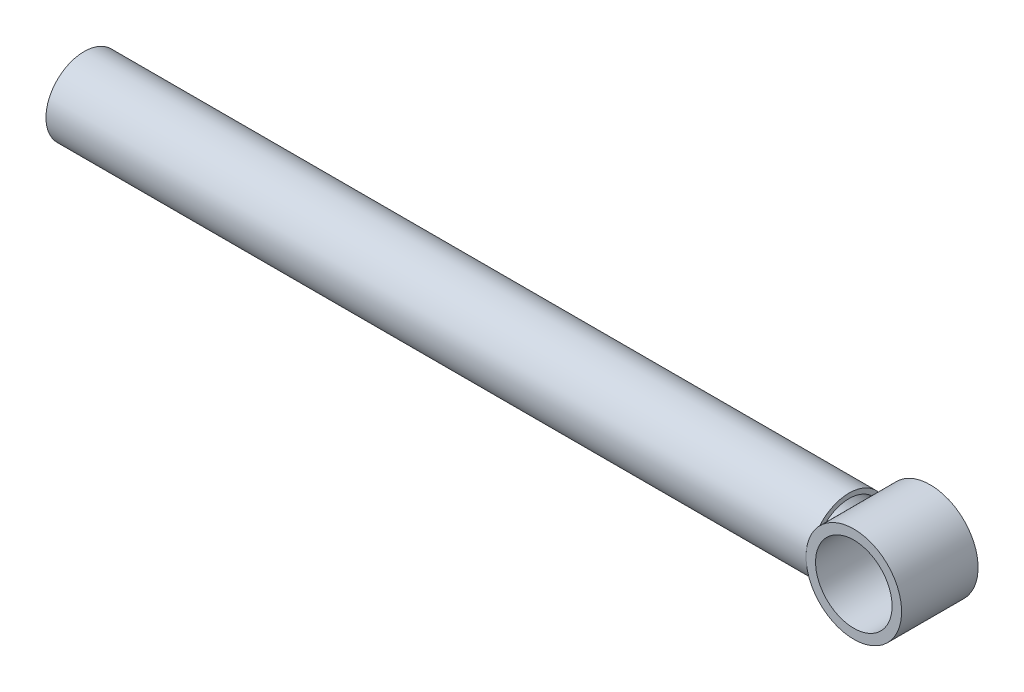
from build123d import *

# Parameters (mm, degrees)
BASE_EXTRUDE_DEPTH      = 50.8
BASE_EXTRUDE_DEPTH_BACK = 50.8
SKETCH1_R               = 63.5
SKETCH1_R_2             = 50.8
SKETCH2_R               = 50.8
SKETCH2_R_2             = 44.45
BOSS_EXTRUDE2_DEPTH     = 1016


with BuildPart() as part:
    # Sketch1 → Base-Extrude (new, two sides: drawn at the far end of the back side and taken through both)
    with BuildSketch(Plane.XY.offset(-BASE_EXTRUDE_DEPTH_BACK)):
        with Locations(Location((0, 0, 0), (0, 0, 180))):
            Circle(SKETCH1_R)
        Circle(SKETCH1_R_2, mode=Mode.SUBTRACT)
    extrude(amount=BASE_EXTRUDE_DEPTH + BASE_EXTRUDE_DEPTH_BACK)

    # Sketch2 → Boss-Extrude2 (add)
    with BuildSketch(Plane(origin=(-57.15, 0, 0), x_dir=(0, 0, -1), z_dir=(1, 0, 0))):
        Circle(SKETCH2_R)
        Circle(SKETCH2_R_2, mode=Mode.SUBTRACT)
    extrude(amount=-BOSS_EXTRUDE2_DEPTH)


solid = part.part
